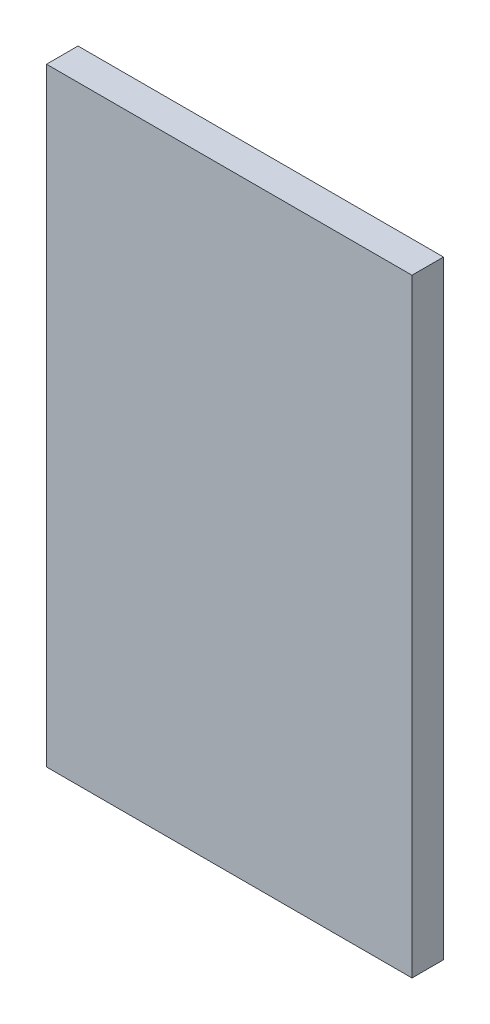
from build123d import *

# Parameters (mm, degrees)
ESQUISSE1_W        = 118.3
ESQUISSE1_H        = 197
BOSS_EXTRU_1_DEPTH = 5.1


with BuildPart() as part:
    # Esquisse1 → Boss.-Extru.1 (new, symmetric)
    with BuildSketch(Plane.XY):
        Rectangle(ESQUISSE1_W, ESQUISSE1_H)
    extrude(amount=BOSS_EXTRU_1_DEPTH, both=True)


solid = part.part
